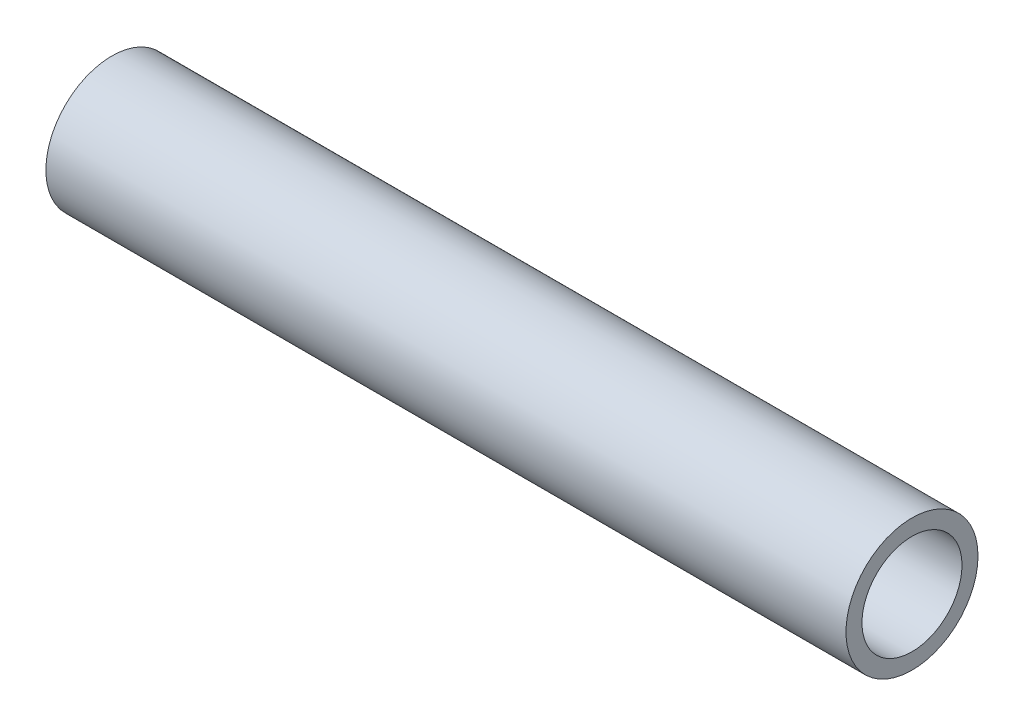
from build123d import *

# Parameters (mm, degrees)
ESQUISSE1_R        = 8.25
ESQUISSE1_R_2      = 6.25
BOSS_EXTRU_1_DEPTH = 100


with BuildPart() as part:
    # Esquisse1 → Boss.-Extru.1 (new body)
    with BuildSketch(Plane(origin=(0, 0, 0), x_dir=(0, 0, -1), z_dir=(1, 0, 0))):
        Circle(ESQUISSE1_R)
        Circle(ESQUISSE1_R_2, mode=Mode.SUBTRACT)
    extrude(amount=BOSS_EXTRU_1_DEPTH)


solid = part.part
